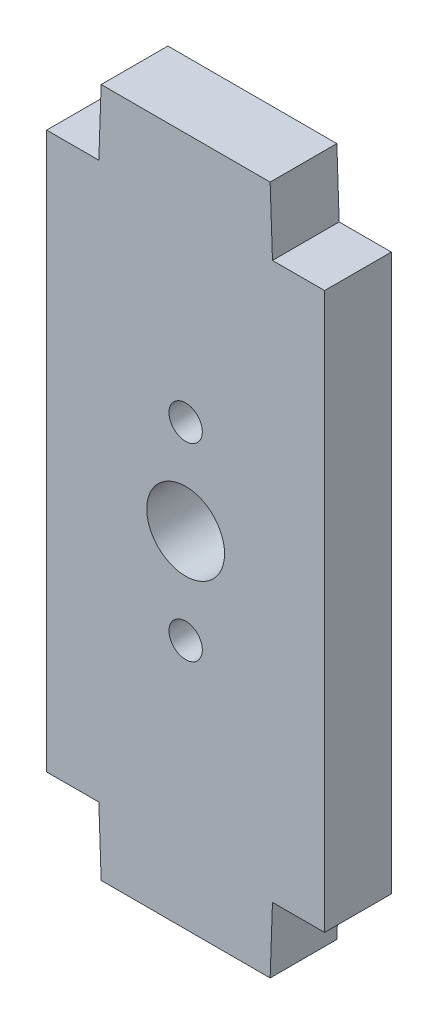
from build123d import *

# Parameters (mm, degrees)
SKETCH1_W                = 25
SKETCH1_H                = 50
BOSS_EXTRUDE1_DEPTH      = 6
SKETCH2_R                = 3.5
SKETCH2_R_2              = 1.5
MOTOR_HOLE_PATTERN_DEPTH = 29.587584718
TABS_DEPTH               = 6


with BuildPart() as part:
    # Sketch1 → Boss-Extrude1 (new body)
    with BuildSketch(Plane.XY):
        Rectangle(SKETCH1_W, SKETCH1_H)
    extrude(amount=BOSS_EXTRUDE1_DEPTH)

    # Sketch2 → motor hole pattern (cut, through all)
    with BuildSketch(Plane.XY.offset(6)):
        Circle(SKETCH2_R)
        with Locations((0, -8.5)):
            Circle(SKETCH2_R_2)
        with Locations((0, 8.5)):
            Circle(SKETCH2_R_2)
    extrude(amount=-MOTOR_HOLE_PATTERN_DEPTH, mode=Mode.SUBTRACT)

    # Sketch3 → tabs (add)
    with BuildSketch(Plane.XY.offset(6)):
        Polygon((7.809524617, -25), (-7.809524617, -25), (-7.6, -31), (7.6, -31), align=None)
        Polygon((-7.809524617, 25), (7.809524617, 25), (7.6, 31), (-7.6, 31), align=None)
    extrude(amount=-TABS_DEPTH)


solid = part.part
